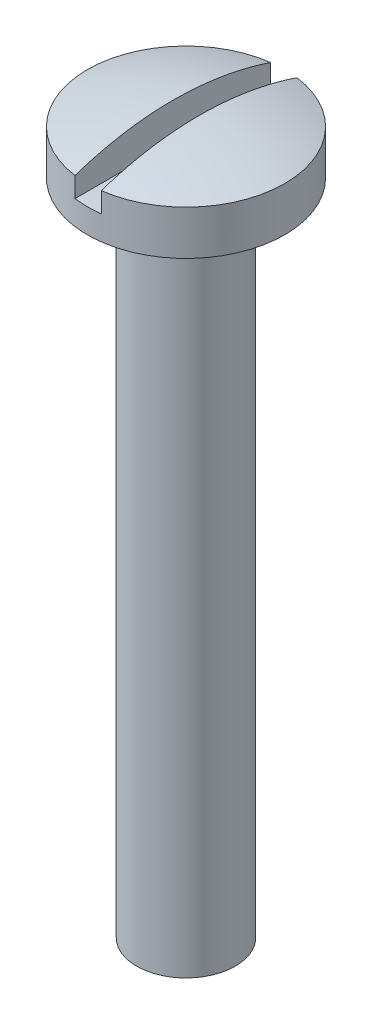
ISO-10303-21;
HEADER;
FILE_DESCRIPTION(('STEP AP214'),'2;1');
FILE_NAME('part.step','',(''),(''),'','','');
FILE_SCHEMA(('AUTOMOTIVE_DESIGN { 1 0 10303 214 1 1 1 1 }'));
ENDSEC;
DATA;
#1=APPLICATION_CONTEXT('core data for automotive mechanical design processes');
#2=APPLICATION_PROTOCOL_DEFINITION('international standard','automotive_design',2000,#1);
#3=PRODUCT_CONTEXT('',#1,'mechanical');
#4=PRODUCT('Part','Part','',(#3));
#5=PRODUCT_RELATED_PRODUCT_CATEGORY('part','',(#4));
#6=PRODUCT_DEFINITION_FORMATION('','',#4);
#7=PRODUCT_DEFINITION_CONTEXT('part definition',#1,'design');
#8=PRODUCT_DEFINITION('design','',#6,#7);
#9=PRODUCT_DEFINITION_SHAPE('','',#8);
#10=(LENGTH_UNIT() NAMED_UNIT(*) SI_UNIT(.MILLI.,.METRE.));
#11=(NAMED_UNIT(*) PLANE_ANGLE_UNIT() SI_UNIT($,.RADIAN.));
#12=(NAMED_UNIT(*) SI_UNIT($,.STERADIAN.) SOLID_ANGLE_UNIT());
#13=UNCERTAINTY_MEASURE_WITH_UNIT(LENGTH_MEASURE(1.E-05),#10,'distance_accuracy_value','');
#14=(GEOMETRIC_REPRESENTATION_CONTEXT(3) GLOBAL_UNCERTAINTY_ASSIGNED_CONTEXT((#13)) GLOBAL_UNIT_ASSIGNED_CONTEXT((#10,
#11,#12)) REPRESENTATION_CONTEXT('',''));
#15=CARTESIAN_POINT('',(0.,0.,0.));
#16=DIRECTION('',(0.,0.,1.));
#17=DIRECTION('',(1.,0.,0.));
#18=AXIS2_PLACEMENT_3D('',#15,#16,#17);
#19=CARTESIAN_POINT('',(0.,25.2,0.));
#20=DIRECTION('',(0.,-1.,0.));
#21=DIRECTION('',(1.,0.,0.));
#22=AXIS2_PLACEMENT_3D('',#19,#20,#21);
#23=SPHERICAL_SURFACE('',#22,18.5);
#24=CARTESIAN_POINT('',(0.,42.7,0.));
#25=DIRECTION('',(0.,-1.,0.));
#26=DIRECTION('',(0.,0.,-1.));
#27=AXIS2_PLACEMENT_3D('',#24,#25,#26);
#28=CIRCLE('',#27,6.);
#29=CARTESIAN_POINT('',(0.799999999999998,42.7,-5.9464274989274));
#30=VERTEX_POINT('',#29);
#31=CARTESIAN_POINT('',(0.8,42.7,5.94642749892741));
#32=VERTEX_POINT('',#31);
#33=EDGE_CURVE('E98',#30,#32,#28,.T.);
#34=ORIENTED_EDGE('',*,*,#33,.F.);
#35=CARTESIAN_POINT('',(0.799999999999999,25.2,0.));
#36=DIRECTION('',(1.,0.,0.));
#37=DIRECTION('',(0.,1.,0.));
#38=AXIS2_PLACEMENT_3D('',#35,#36,#37);
#39=CIRCLE('',#38,18.4826946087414);
#40=EDGE_CURVE('E109',#32,#30,#39,.F.);
#41=ORIENTED_EDGE('',*,*,#40,.F.);
#42=EDGE_LOOP('',(#34,#41));
#43=FACE_BOUND('',#42,.T.);
#44=ADVANCED_FACE('F36',(#43),#23,.T.);
#45=CARTESIAN_POINT('',(3.00000000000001,0.,0.));
#46=DIRECTION('',(0.,-1.,0.));
#47=DIRECTION('',(0.,0.,-1.));
#48=AXIS2_PLACEMENT_3D('',#45,#46,#47);
#49=PLANE('',#48);
#50=CARTESIAN_POINT('',(0.,0.,0.));
#51=DIRECTION('',(0.,-1.,0.));
#52=DIRECTION('',(0.,0.,-1.));
#53=AXIS2_PLACEMENT_3D('',#50,#51,#52);
#54=CIRCLE('',#53,3.00000000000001);
#55=CARTESIAN_POINT('',(0.,0.,-3.00000000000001));
#56=VERTEX_POINT('',#55);
#57=EDGE_CURVE('E112',#56,#56,#54,.T.);
#58=ORIENTED_EDGE('',*,*,#57,.T.);
#59=EDGE_LOOP('',(#58));
#60=FACE_BOUND('',#59,.T.);
#61=ADVANCED_FACE('F38',(#60),#49,.T.);
#62=CARTESIAN_POINT('',(-0.799999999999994,25.2,0.));
#63=DIRECTION('',(-1.,0.,0.));
#64=DIRECTION('',(0.,-1.,0.));
#65=AXIS2_PLACEMENT_3D('',#62,#63,#64);
#66=CIRCLE('',#65,18.4826946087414);
#67=CARTESIAN_POINT('',(-0.8,42.7,-5.94642749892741));
#68=VERTEX_POINT('',#67);
#69=CARTESIAN_POINT('',(-0.799999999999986,42.7,5.94642749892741));
#70=VERTEX_POINT('',#69);
#71=EDGE_CURVE('E50',#68,#70,#66,.F.);
#72=ORIENTED_EDGE('',*,*,#71,.F.);
#73=EDGE_CURVE('E96',#70,#68,#28,.T.);
#74=ORIENTED_EDGE('',*,*,#73,.F.);
#75=EDGE_LOOP('',(#72,#74));
#76=FACE_BOUND('',#75,.T.);
#77=ADVANCED_FACE('F132',(#76),#23,.T.);
#78=CARTESIAN_POINT('',(0.,0.,0.));
#79=DIRECTION('',(0.,-1.,0.));
#80=DIRECTION('',(0.,0.,-1.));
#81=AXIS2_PLACEMENT_3D('',#78,#79,#80);
#82=CYLINDRICAL_SURFACE('',#81,6.);
#83=DIRECTION('',(0.,-1.,0.));
#84=VECTOR('',#83,1.);
#85=CARTESIAN_POINT('',(-0.799999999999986,0.,-5.94642749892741));
#86=LINE('',#85,#84);
#87=CARTESIAN_POINT('',(-0.8,41.4826946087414,-5.94642749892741));
#88=VERTEX_POINT('',#87);
#89=EDGE_CURVE('E11',#88,#68,#86,.F.);
#90=ORIENTED_EDGE('',*,*,#89,.F.);
#91=CARTESIAN_POINT('',(0.,41.4826946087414,0.));
#92=DIRECTION('',(0.,-1.,0.));
#93=DIRECTION('',(0.,0.,-1.));
#94=AXIS2_PLACEMENT_3D('',#91,#92,#93);
#95=CIRCLE('',#94,6.);
#96=CARTESIAN_POINT('',(0.8,41.4826946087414,-5.9464274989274));
#97=VERTEX_POINT('',#96);
#98=EDGE_CURVE('E79',#97,#88,#95,.F.);
#99=ORIENTED_EDGE('',*,*,#98,.F.);
#100=DIRECTION('',(0.,-1.,0.));
#101=VECTOR('',#100,1.);
#102=CARTESIAN_POINT('',(0.799999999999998,0.,-5.9464274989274));
#103=LINE('',#102,#101);
#104=EDGE_CURVE('E87',#30,#97,#103,.T.);
#105=ORIENTED_EDGE('',*,*,#104,.F.);
#106=ORIENTED_EDGE('',*,*,#33,.T.);
#107=DIRECTION('',(0.,-1.,0.));
#108=VECTOR('',#107,1.);
#109=CARTESIAN_POINT('',(0.799999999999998,0.,5.9464274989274));
#110=LINE('',#109,#108);
#111=CARTESIAN_POINT('',(0.8,41.4826946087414,5.9464274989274));
#112=VERTEX_POINT('',#111);
#113=EDGE_CURVE('E58',#112,#32,#110,.F.);
#114=ORIENTED_EDGE('',*,*,#113,.F.);
#115=CARTESIAN_POINT('',(-0.8,41.4826946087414,5.94642749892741));
#116=VERTEX_POINT('',#115);
#117=EDGE_CURVE('E89',#116,#112,#95,.F.);
#118=ORIENTED_EDGE('',*,*,#117,.F.);
#119=DIRECTION('',(0.,-1.,0.));
#120=VECTOR('',#119,1.);
#121=CARTESIAN_POINT('',(-0.799999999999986,0.,5.94642749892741));
#122=LINE('',#121,#120);
#123=EDGE_CURVE('E44',#70,#116,#122,.T.);
#124=ORIENTED_EDGE('',*,*,#123,.F.);
#125=ORIENTED_EDGE('',*,*,#73,.T.);
#126=EDGE_LOOP('',(#90,#99,#105,#106,#114,#118,#124,#125));
#127=FACE_BOUND('',#126,.T.);
#128=CARTESIAN_POINT('',(0.,40.,0.));
#129=DIRECTION('',(0.,-1.,0.));
#130=DIRECTION('',(0.,0.,-1.));
#131=AXIS2_PLACEMENT_3D('',#128,#129,#130);
#132=CIRCLE('',#131,6.);
#133=CARTESIAN_POINT('',(0.,40.,-6.));
#134=VERTEX_POINT('',#133);
#135=EDGE_CURVE('E99',#134,#134,#132,.T.);
#136=ORIENTED_EDGE('',*,*,#135,.F.);
#137=EDGE_LOOP('',(#136));
#138=FACE_BOUND('',#137,.T.);
#139=ADVANCED_FACE('F93',(#127,#138),#82,.T.);
#140=CARTESIAN_POINT('',(6.,40.,0.));
#141=DIRECTION('',(0.,-1.,0.));
#142=DIRECTION('',(0.,0.,-1.));
#143=AXIS2_PLACEMENT_3D('',#140,#141,#142);
#144=PLANE('',#143);
#145=ORIENTED_EDGE('',*,*,#135,.T.);
#146=EDGE_LOOP('',(#145));
#147=FACE_BOUND('',#146,.T.);
#148=CARTESIAN_POINT('',(0.,40.,0.));
#149=DIRECTION('',(0.,-1.,0.));
#150=DIRECTION('',(0.,0.,-1.));
#151=AXIS2_PLACEMENT_3D('',#148,#149,#150);
#152=CIRCLE('',#151,3.);
#153=CARTESIAN_POINT('',(0.,40.,-3.));
#154=VERTEX_POINT('',#153);
#155=EDGE_CURVE('E103',#154,#154,#152,.T.);
#156=ORIENTED_EDGE('',*,*,#155,.F.);
#157=EDGE_LOOP('',(#156));
#158=FACE_BOUND('',#157,.T.);
#159=ADVANCED_FACE('F123',(#147,#158),#144,.T.);
#160=CARTESIAN_POINT('',(0.,0.,0.));
#161=DIRECTION('',(0.,-1.,0.));
#162=DIRECTION('',(0.,0.,-1.));
#163=AXIS2_PLACEMENT_3D('',#160,#161,#162);
#164=CYLINDRICAL_SURFACE('',#163,3.);
#165=ORIENTED_EDGE('',*,*,#155,.T.);
#166=EDGE_LOOP('',(#165));
#167=FACE_BOUND('',#166,.T.);
#168=ORIENTED_EDGE('',*,*,#57,.F.);
#169=EDGE_LOOP('',(#168));
#170=FACE_BOUND('',#169,.T.);
#171=ADVANCED_FACE('F120',(#167,#170),#164,.T.);
#172=CARTESIAN_POINT('',(0.8,41.4826946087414,-6.));
#173=DIRECTION('',(1.,0.,0.));
#174=DIRECTION('',(0.,1.,0.));
#175=AXIS2_PLACEMENT_3D('',#172,#173,#174);
#176=PLANE('',#175);
#177=ORIENTED_EDGE('',*,*,#113,.T.);
#178=ORIENTED_EDGE('',*,*,#40,.T.);
#179=ORIENTED_EDGE('',*,*,#104,.T.);
#180=DIRECTION('',(0.,0.,1.));
#181=VECTOR('',#180,1.);
#182=CARTESIAN_POINT('',(0.8,41.4826946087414,-6.));
#183=LINE('',#182,#181);
#184=EDGE_CURVE('E83',#97,#112,#183,.T.);
#185=ORIENTED_EDGE('',*,*,#184,.T.);
#186=EDGE_LOOP('',(#177,#178,#179,#185));
#187=FACE_BOUND('',#186,.T.);
#188=ADVANCED_FACE('F108',(#187),#176,.F.);
#189=CARTESIAN_POINT('',(-0.8,41.4826946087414,-6.));
#190=DIRECTION('',(0.,-1.,0.));
#191=DIRECTION('',(0.,0.,-1.));
#192=AXIS2_PLACEMENT_3D('',#189,#190,#191);
#193=PLANE('',#192);
#194=DIRECTION('',(0.,0.,1.));
#195=VECTOR('',#194,1.);
#196=CARTESIAN_POINT('',(-0.8,41.4826946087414,-6.));
#197=LINE('',#196,#195);
#198=EDGE_CURVE('E82',#88,#116,#197,.T.);
#199=ORIENTED_EDGE('',*,*,#198,.T.);
#200=ORIENTED_EDGE('',*,*,#117,.T.);
#201=ORIENTED_EDGE('',*,*,#184,.F.);
#202=ORIENTED_EDGE('',*,*,#98,.T.);
#203=EDGE_LOOP('',(#199,#200,#201,#202));
#204=FACE_BOUND('',#203,.T.);
#205=ADVANCED_FACE('F81',(#204),#193,.F.);
#206=CARTESIAN_POINT('',(-0.800000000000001,43.6826946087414,-6.));
#207=DIRECTION('',(-1.,0.,0.));
#208=DIRECTION('',(0.,-1.,0.));
#209=AXIS2_PLACEMENT_3D('',#206,#207,#208);
#210=PLANE('',#209);
#211=ORIENTED_EDGE('',*,*,#89,.T.);
#212=ORIENTED_EDGE('',*,*,#71,.T.);
#213=ORIENTED_EDGE('',*,*,#123,.T.);
#214=ORIENTED_EDGE('',*,*,#198,.F.);
#215=EDGE_LOOP('',(#211,#212,#213,#214));
#216=FACE_BOUND('',#215,.T.);
#217=ADVANCED_FACE('F90',(#216),#210,.F.);
#218=CLOSED_SHELL('',(#44,#61,#77,#139,#159,#171,#188,#205,#217));
#219=MANIFOLD_SOLID_BREP('B2',#218);
#220=ADVANCED_BREP_SHAPE_REPRESENTATION('',(#18,#219),#14);
#221=SHAPE_DEFINITION_REPRESENTATION(#9,#220);
ENDSEC;
END-ISO-10303-21;
